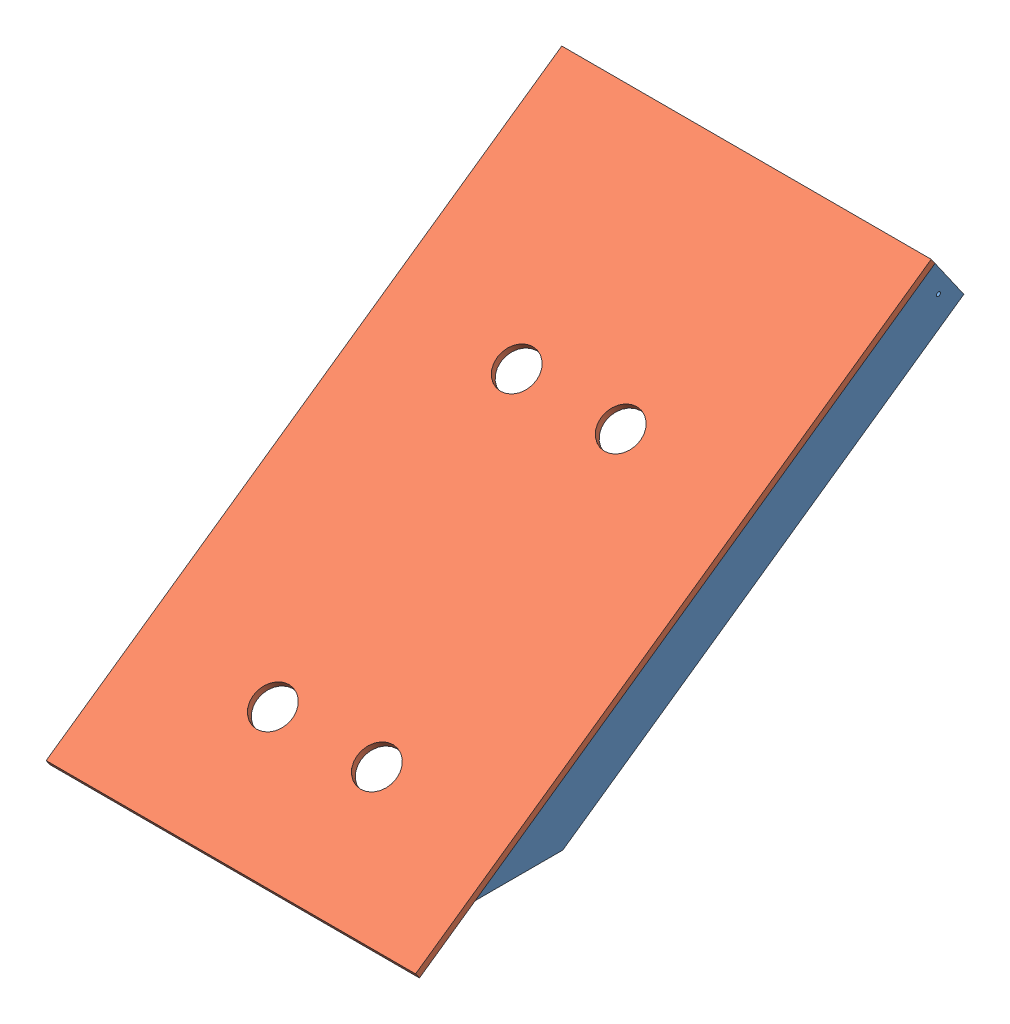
SolidWorks assembly TE-23034.SLDASM, configuration Default (file format 15000). Lengths in mm.
Overall size (654.05 652.58 970.7).
3 component instances, 2 part files, 6 mates.
Components (placement in the parent):
- TE-23013-1: TE-23013.SLDPRT [Default] at (107.1562 623.2583 24.9439) x (1 0 0) z (0 -0.573576 0.819152) size (38.1 88.9 993.77)
- TE-23014-1: TE-23014.SLDPRT [Default] at (507.2062 349.8187 513.7103) x (-1 0 0) z (0 -0.819152 -0.573576) size (654.05 1114.42 11.91)
- TE-23013-2: TE-23013.SLDPRT [Default] at (723.1062 623.2583 24.9439) x (1 0 0) z (0 -0.573576 0.819152) size (38.1 88.9 993.77)
Mates (geometry in assembly coordinates):
- Coincident227: coincident aligned: plane of Cone Ramp Diagonal-1 through (107.1562 623.2583 24.9439) normal (0 0.573576 -0.819152); plane of Cone Ramp Diagonal Wide Panel-1 through (742.1562 659.6696 50.4394) normal (0 0.573576 -0.819152)
- Coincident230: coincident aligned: plane of Cone Ramp Diagonal-1 through (88.1063 -68.7509 935.7393) normal (-1 0 0); plane of Cone Ramp Diagonal Wide Panel-1 through (88.1063 349.8187 513.7103) normal (-1 0 0)
- Coincident231: coincident anti-aligned: plane of Cone Ramp Diagonal-1 through (88.1063 4.0717 986.7302) normal (0 0.819152 0.573576); plane of Cone Ramp Diagonal Wide Panel-1 through (507.2062 340.0656 506.8812) normal (0 -0.819152 -0.573576)
- Coincident224: coincident anti-aligned: plane of Cone Ramp Diagonal Wide Panel-1 through (507.2062 340.0656 506.8812) normal (0 -0.819152 -0.573576); plane of Cone Ramp Diagonal-2 through (704.0563 4.0717 986.7302) normal (0 0.819152 0.573576)
- Coincident225: coincident aligned: plane of Cone Ramp Diagonal Wide Panel-1 through (742.1562 659.6696 50.4394) normal (0 0.573576 -0.819152); plane of Cone Ramp Diagonal-2 through (723.1062 623.2583 24.9439) normal (0 0.573576 -0.819152)
- Coincident226: coincident aligned: plane of Cone Ramp Diagonal Wide Panel-1 through (742.1562 20.4617 963.3229) normal (1 0 0); plane of Cone Ramp Diagonal-2 through (742.1562 -68.7509 935.7393) normal (1 0 0)
